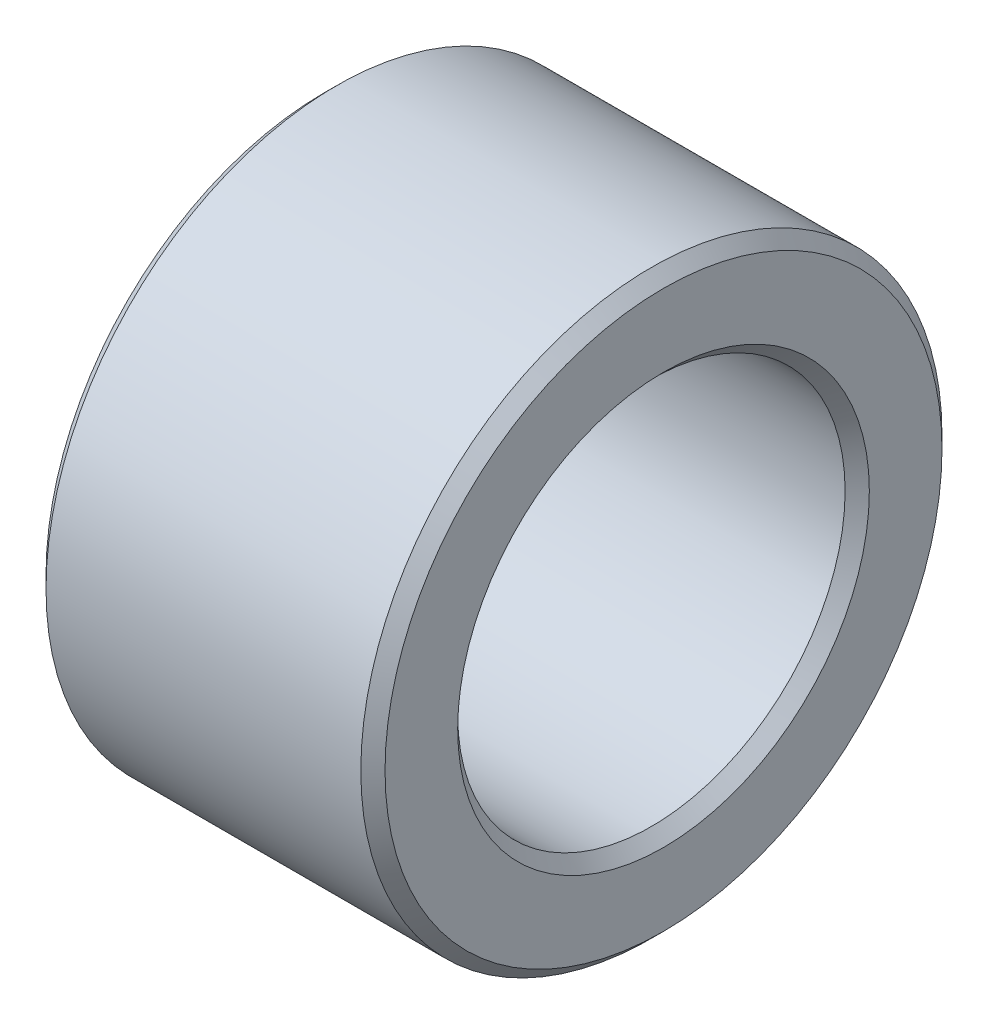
from build123d import *

# Parameters (mm, degrees)
SKETCH1_R      = 6
SKETCH1_R_2    = 4
EXTRUDE1_DEPTH = 7
CHAMFER1_SIZE  = 0.25


with BuildPart() as part:
    # Sketch1 → Extrude1 (new body)
    with BuildSketch(Plane(origin=(0, 0, 0), x_dir=(0, 0, -1), z_dir=(1, 0, 0))):
        Circle(SKETCH1_R)
        Circle(SKETCH1_R_2, mode=Mode.SUBTRACT)
    extrude(amount=EXTRUDE1_DEPTH)

    # Chamfer1
    chamfer1_edges = [part.edges().sort_by_distance(p)[0] for p in [
        (0, 0, 6),
        (7, 0, 6),
        (0, 0, 4),
        (7, 0, 4),
    ]]
    chamfer(chamfer1_edges, length=CHAMFER1_SIZE)


solid = part.part
